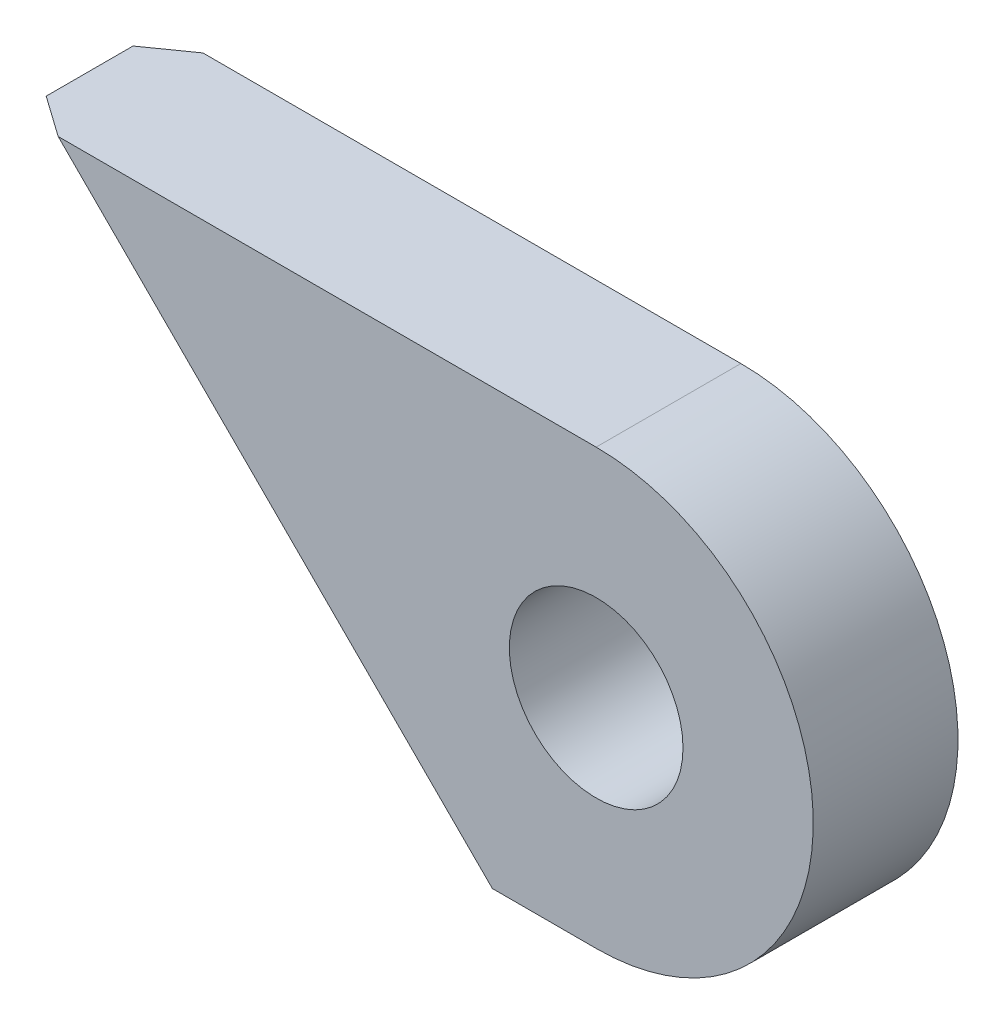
ISO-10303-21;
HEADER;
FILE_DESCRIPTION(('STEP AP214'),'2;1');
FILE_NAME('part.step','',(''),(''),'','','');
FILE_SCHEMA(('AUTOMOTIVE_DESIGN { 1 0 10303 214 1 1 1 1 }'));
ENDSEC;
DATA;
#1=APPLICATION_CONTEXT('core data for automotive mechanical design processes');
#2=APPLICATION_PROTOCOL_DEFINITION('international standard','automotive_design',2000,#1);
#3=PRODUCT_CONTEXT('',#1,'mechanical');
#4=PRODUCT('Part','Part','',(#3));
#5=PRODUCT_RELATED_PRODUCT_CATEGORY('part','',(#4));
#6=PRODUCT_DEFINITION_FORMATION('','',#4);
#7=PRODUCT_DEFINITION_CONTEXT('part definition',#1,'design');
#8=PRODUCT_DEFINITION('design','',#6,#7);
#9=PRODUCT_DEFINITION_SHAPE('','',#8);
#10=(LENGTH_UNIT() NAMED_UNIT(*) SI_UNIT(.MILLI.,.METRE.));
#11=(NAMED_UNIT(*) PLANE_ANGLE_UNIT() SI_UNIT($,.RADIAN.));
#12=(NAMED_UNIT(*) SI_UNIT($,.STERADIAN.) SOLID_ANGLE_UNIT());
#13=UNCERTAINTY_MEASURE_WITH_UNIT(LENGTH_MEASURE(1.E-05),#10,'distance_accuracy_value','');
#14=(GEOMETRIC_REPRESENTATION_CONTEXT(3) GLOBAL_UNCERTAINTY_ASSIGNED_CONTEXT((#13)) GLOBAL_UNIT_ASSIGNED_CONTEXT((#10,
#11,#12)) REPRESENTATION_CONTEXT('',''));
#15=CARTESIAN_POINT('',(0.,0.,0.));
#16=DIRECTION('',(0.,0.,1.));
#17=DIRECTION('',(1.,0.,0.));
#18=AXIS2_PLACEMENT_3D('',#15,#16,#17);
#19=CARTESIAN_POINT('',(0.,0.,10.));
#20=DIRECTION('',(0.,-1.,0.));
#21=DIRECTION('',(0.,0.,-1.));
#22=AXIS2_PLACEMENT_3D('',#19,#20,#21);
#23=PLANE('',#22);
#24=DIRECTION('',(-1.,0.,0.));
#25=VECTOR('',#24,1.);
#26=CARTESIAN_POINT('',(0.,0.,0.));
#27=LINE('',#26,#25);
#28=CARTESIAN_POINT('',(40.,0.,0.));
#29=VERTEX_POINT('',#28);
#30=CARTESIAN_POINT('',(2.82842712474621,0.,0.));
#31=VERTEX_POINT('',#30);
#32=EDGE_CURVE('E113',#29,#31,#27,.T.);
#33=ORIENTED_EDGE('',*,*,#32,.T.);
#34=DIRECTION('',(0.816496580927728,0.,-0.577350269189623));
#35=VECTOR('',#34,1.);
#36=CARTESIAN_POINT('',(0.,0.,2.));
#37=LINE('',#36,#35);
#38=CARTESIAN_POINT('',(0.,0.,2.));
#39=VERTEX_POINT('',#38);
#40=EDGE_CURVE('E39',#31,#39,#37,.F.);
#41=ORIENTED_EDGE('',*,*,#40,.T.);
#42=DIRECTION('',(0.,0.,-1.));
#43=VECTOR('',#42,1.);
#44=CARTESIAN_POINT('',(0.,0.,10.));
#45=LINE('',#44,#43);
#46=CARTESIAN_POINT('',(0.,0.,7.99999999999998));
#47=VERTEX_POINT('',#46);
#48=EDGE_CURVE('E120',#47,#39,#45,.T.);
#49=ORIENTED_EDGE('',*,*,#48,.F.);
#50=DIRECTION('',(0.816496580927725,0.,0.577350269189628));
#51=VECTOR('',#50,1.);
#52=CARTESIAN_POINT('',(20.2189514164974,0.,22.2969576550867));
#53=LINE('',#52,#51);
#54=CARTESIAN_POINT('',(2.82842712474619,0.,10.));
#55=VERTEX_POINT('',#54);
#56=EDGE_CURVE('E46',#47,#55,#53,.T.);
#57=ORIENTED_EDGE('',*,*,#56,.T.);
#58=DIRECTION('',(-1.,0.,0.));
#59=VECTOR('',#58,1.);
#60=CARTESIAN_POINT('',(0.,0.,10.));
#61=LINE('',#60,#59);
#62=CARTESIAN_POINT('',(40.,0.,10.));
#63=VERTEX_POINT('',#62);
#64=EDGE_CURVE('E95',#63,#55,#61,.T.);
#65=ORIENTED_EDGE('',*,*,#64,.F.);
#66=DIRECTION('',(0.,0.,-1.));
#67=VECTOR('',#66,1.);
#68=CARTESIAN_POINT('',(40.,0.,10.));
#69=LINE('',#68,#67);
#70=EDGE_CURVE('E105',#63,#29,#69,.T.);
#71=ORIENTED_EDGE('',*,*,#70,.T.);
#72=EDGE_LOOP('',(#33,#41,#49,#57,#65,#71));
#73=FACE_BOUND('',#72,.T.);
#74=ADVANCED_FACE('F31',(#73),#23,.F.);
#75=CARTESIAN_POINT('',(0.,0.,10.));
#76=DIRECTION('',(0.707106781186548,0.707106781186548,0.));
#77=DIRECTION('',(-0.707106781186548,0.707106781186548,0.));
#78=AXIS2_PLACEMENT_3D('',#75,#76,#77);
#79=PLANE('',#78);
#80=ORIENTED_EDGE('',*,*,#48,.T.);
#81=DIRECTION('',(0.707106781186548,-0.707106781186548,0.));
#82=VECTOR('',#81,1.);
#83=CARTESIAN_POINT('',(0.,0.,2.));
#84=LINE('',#83,#82);
#85=CARTESIAN_POINT('',(30.,-30.,2.));
#86=VERTEX_POINT('',#85);
#87=EDGE_CURVE('E125',#39,#86,#84,.T.);
#88=ORIENTED_EDGE('',*,*,#87,.T.);
#89=DIRECTION('',(0.,0.,-1.));
#90=VECTOR('',#89,1.);
#91=CARTESIAN_POINT('',(30.,-30.,10.));
#92=LINE('',#91,#90);
#93=CARTESIAN_POINT('',(30.,-30.,7.99999999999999));
#94=VERTEX_POINT('',#93);
#95=EDGE_CURVE('E104',#94,#86,#92,.T.);
#96=ORIENTED_EDGE('',*,*,#95,.F.);
#97=DIRECTION('',(-0.707106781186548,0.707106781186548,0.));
#98=VECTOR('',#97,1.);
#99=CARTESIAN_POINT('',(0.,0.,7.99999999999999));
#100=LINE('',#99,#98);
#101=EDGE_CURVE('E123',#94,#47,#100,.T.);
#102=ORIENTED_EDGE('',*,*,#101,.T.);
#103=EDGE_LOOP('',(#80,#88,#96,#102));
#104=FACE_BOUND('',#103,.T.);
#105=ADVANCED_FACE('F137',(#104),#79,.F.);
#106=CARTESIAN_POINT('',(30.,-30.,10.));
#107=DIRECTION('',(0.,1.,0.));
#108=DIRECTION('',(0.,0.,1.));
#109=AXIS2_PLACEMENT_3D('',#106,#107,#108);
#110=PLANE('',#109);
#111=ORIENTED_EDGE('',*,*,#95,.T.);
#112=DIRECTION('',(-0.816496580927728,0.,0.577350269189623));
#113=VECTOR('',#112,1.);
#114=CARTESIAN_POINT('',(9.99999999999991,-30.,16.1421356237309));
#115=LINE('',#114,#113);
#116=CARTESIAN_POINT('',(32.8284271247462,-30.,0.));
#117=VERTEX_POINT('',#116);
#118=EDGE_CURVE('E130',#86,#117,#115,.F.);
#119=ORIENTED_EDGE('',*,*,#118,.T.);
#120=DIRECTION('',(1.,0.,0.));
#121=VECTOR('',#120,1.);
#122=CARTESIAN_POINT('',(30.,-30.,0.));
#123=LINE('',#122,#121);
#124=CARTESIAN_POINT('',(40.,-30.,0.));
#125=VERTEX_POINT('',#124);
#126=EDGE_CURVE('E101',#117,#125,#123,.T.);
#127=ORIENTED_EDGE('',*,*,#126,.T.);
#128=DIRECTION('',(0.,0.,-1.));
#129=VECTOR('',#128,1.);
#130=CARTESIAN_POINT('',(40.,-30.,10.));
#131=LINE('',#130,#129);
#132=CARTESIAN_POINT('',(40.,-30.,10.));
#133=VERTEX_POINT('',#132);
#134=EDGE_CURVE('E98',#133,#125,#131,.T.);
#135=ORIENTED_EDGE('',*,*,#134,.F.);
#136=DIRECTION('',(1.,0.,0.));
#137=VECTOR('',#136,1.);
#138=CARTESIAN_POINT('',(30.,-30.,10.));
#139=LINE('',#138,#137);
#140=CARTESIAN_POINT('',(32.8284271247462,-30.,10.));
#141=VERTEX_POINT('',#140);
#142=EDGE_CURVE('E87',#141,#133,#139,.T.);
#143=ORIENTED_EDGE('',*,*,#142,.F.);
#144=DIRECTION('',(-0.816496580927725,0.,-0.577350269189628));
#145=VECTOR('',#144,1.);
#146=CARTESIAN_POINT('',(30.2189514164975,-30.,8.15482203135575));
#147=LINE('',#146,#145);
#148=EDGE_CURVE('E128',#141,#94,#147,.T.);
#149=ORIENTED_EDGE('',*,*,#148,.T.);
#150=EDGE_LOOP('',(#111,#119,#127,#135,#143,#149));
#151=FACE_BOUND('',#150,.T.);
#152=ADVANCED_FACE('F100',(#151),#110,.F.);
#153=CARTESIAN_POINT('',(40.,-15.,10.));
#154=DIRECTION('',(0.,0.,-1.));
#155=DIRECTION('',(-1.,0.,0.));
#156=AXIS2_PLACEMENT_3D('',#153,#154,#155);
#157=CYLINDRICAL_SURFACE('',#156,15.);
#158=CARTESIAN_POINT('',(40.,-15.,0.));
#159=DIRECTION('',(0.,0.,1.));
#160=DIRECTION('',(1.,0.,0.));
#161=AXIS2_PLACEMENT_3D('',#158,#159,#160);
#162=CIRCLE('',#161,15.);
#163=EDGE_CURVE('E117',#125,#29,#162,.T.);
#164=ORIENTED_EDGE('',*,*,#163,.T.);
#165=ORIENTED_EDGE('',*,*,#70,.F.);
#166=CARTESIAN_POINT('',(40.,-15.,10.));
#167=DIRECTION('',(0.,0.,1.));
#168=DIRECTION('',(1.,0.,0.));
#169=AXIS2_PLACEMENT_3D('',#166,#167,#168);
#170=CIRCLE('',#169,15.);
#171=EDGE_CURVE('E91',#133,#63,#170,.T.);
#172=ORIENTED_EDGE('',*,*,#171,.F.);
#173=ORIENTED_EDGE('',*,*,#134,.T.);
#174=EDGE_LOOP('',(#164,#165,#172,#173));
#175=FACE_BOUND('',#174,.T.);
#176=ADVANCED_FACE('F107',(#175),#157,.T.);
#177=CARTESIAN_POINT('',(40.,-15.,10.));
#178=DIRECTION('',(0.,0.,1.));
#179=DIRECTION('',(1.,0.,0.));
#180=AXIS2_PLACEMENT_3D('',#177,#178,#179);
#181=PLANE('',#180);
#182=CARTESIAN_POINT('',(40.,-15.,10.));
#183=DIRECTION('',(0.,0.,1.));
#184=DIRECTION('',(1.,0.,0.));
#185=AXIS2_PLACEMENT_3D('',#182,#183,#184);
#186=CIRCLE('',#185,6.);
#187=CARTESIAN_POINT('',(46.,-15.,10.));
#188=VERTEX_POINT('',#187);
#189=EDGE_CURVE('E143',#188,#188,#186,.T.);
#190=ORIENTED_EDGE('',*,*,#189,.F.);
#191=EDGE_LOOP('',(#190));
#192=FACE_BOUND('',#191,.T.);
#193=ORIENTED_EDGE('',*,*,#64,.T.);
#194=DIRECTION('',(0.707106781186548,-0.707106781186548,0.));
#195=VECTOR('',#194,1.);
#196=CARTESIAN_POINT('',(31.4142135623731,-28.5857864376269,10.));
#197=LINE('',#196,#195);
#198=EDGE_CURVE('E11',#55,#141,#197,.T.);
#199=ORIENTED_EDGE('',*,*,#198,.T.);
#200=ORIENTED_EDGE('',*,*,#142,.T.);
#201=ORIENTED_EDGE('',*,*,#171,.T.);
#202=EDGE_LOOP('',(#193,#199,#200,#201));
#203=FACE_BOUND('',#202,.T.);
#204=ADVANCED_FACE('F89',(#192,#203),#181,.T.);
#205=CARTESIAN_POINT('',(40.,-15.,0.));
#206=DIRECTION('',(0.,0.,1.));
#207=DIRECTION('',(1.,0.,0.));
#208=AXIS2_PLACEMENT_3D('',#205,#206,#207);
#209=PLANE('',#208);
#210=CARTESIAN_POINT('',(40.,-15.,0.));
#211=DIRECTION('',(0.,0.,1.));
#212=DIRECTION('',(1.,0.,0.));
#213=AXIS2_PLACEMENT_3D('',#210,#211,#212);
#214=CIRCLE('',#213,6.);
#215=CARTESIAN_POINT('',(46.,-15.,0.));
#216=VERTEX_POINT('',#215);
#217=EDGE_CURVE('E115',#216,#216,#214,.T.);
#218=ORIENTED_EDGE('',*,*,#217,.T.);
#219=EDGE_LOOP('',(#218));
#220=FACE_BOUND('',#219,.T.);
#221=ORIENTED_EDGE('',*,*,#126,.F.);
#222=DIRECTION('',(-0.707106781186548,0.707106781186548,0.));
#223=VECTOR('',#222,1.);
#224=CARTESIAN_POINT('',(28.9142135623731,-26.0857864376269,0.));
#225=LINE('',#224,#223);
#226=EDGE_CURVE('E54',#117,#31,#225,.T.);
#227=ORIENTED_EDGE('',*,*,#226,.T.);
#228=ORIENTED_EDGE('',*,*,#32,.F.);
#229=ORIENTED_EDGE('',*,*,#163,.F.);
#230=EDGE_LOOP('',(#221,#227,#228,#229));
#231=FACE_BOUND('',#230,.T.);
#232=ADVANCED_FACE('F141',(#220,#231),#209,.F.);
#233=CARTESIAN_POINT('',(40.,-15.,0.));
#234=DIRECTION('',(0.,0.,1.));
#235=DIRECTION('',(1.,0.,0.));
#236=AXIS2_PLACEMENT_3D('',#233,#234,#235);
#237=CYLINDRICAL_SURFACE('',#236,6.);
#238=ORIENTED_EDGE('',*,*,#217,.F.);
#239=EDGE_LOOP('',(#238));
#240=FACE_BOUND('',#239,.T.);
#241=ORIENTED_EDGE('',*,*,#189,.T.);
#242=EDGE_LOOP('',(#241));
#243=FACE_BOUND('',#242,.T.);
#244=ADVANCED_FACE('F150',(#240,#243),#237,.F.);
#245=CARTESIAN_POINT('',(0.,0.,2.));
#246=DIRECTION('',(0.499999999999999,0.499999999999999,0.70710678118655));
#247=DIRECTION('',(0.816496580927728,0.,-0.577350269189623));
#248=AXIS2_PLACEMENT_3D('',#245,#246,#247);
#249=PLANE('',#248);
#250=ORIENTED_EDGE('',*,*,#40,.F.);
#251=ORIENTED_EDGE('',*,*,#226,.F.);
#252=ORIENTED_EDGE('',*,*,#118,.F.);
#253=ORIENTED_EDGE('',*,*,#87,.F.);
#254=EDGE_LOOP('',(#250,#251,#252,#253));
#255=FACE_BOUND('',#254,.T.);
#256=ADVANCED_FACE('F140',(#255),#249,.F.);
#257=CARTESIAN_POINT('',(28.9142135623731,-26.0857864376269,10.));
#258=DIRECTION('',(-0.500000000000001,-0.500000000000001,0.707106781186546));
#259=DIRECTION('',(0.816496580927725,0.,0.577350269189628));
#260=AXIS2_PLACEMENT_3D('',#257,#258,#259);
#261=PLANE('',#260);
#262=ORIENTED_EDGE('',*,*,#56,.F.);
#263=ORIENTED_EDGE('',*,*,#101,.F.);
#264=ORIENTED_EDGE('',*,*,#148,.F.);
#265=ORIENTED_EDGE('',*,*,#198,.F.);
#266=EDGE_LOOP('',(#262,#263,#264,#265));
#267=FACE_BOUND('',#266,.T.);
#268=ADVANCED_FACE('F33',(#267),#261,.T.);
#269=CLOSED_SHELL('',(#74,#105,#152,#176,#204,#232,#244,#256,#268));
#270=MANIFOLD_SOLID_BREP('B2',#269);
#271=ADVANCED_BREP_SHAPE_REPRESENTATION('',(#18,#270),#14);
#272=SHAPE_DEFINITION_REPRESENTATION(#9,#271);
ENDSEC;
END-ISO-10303-21;
